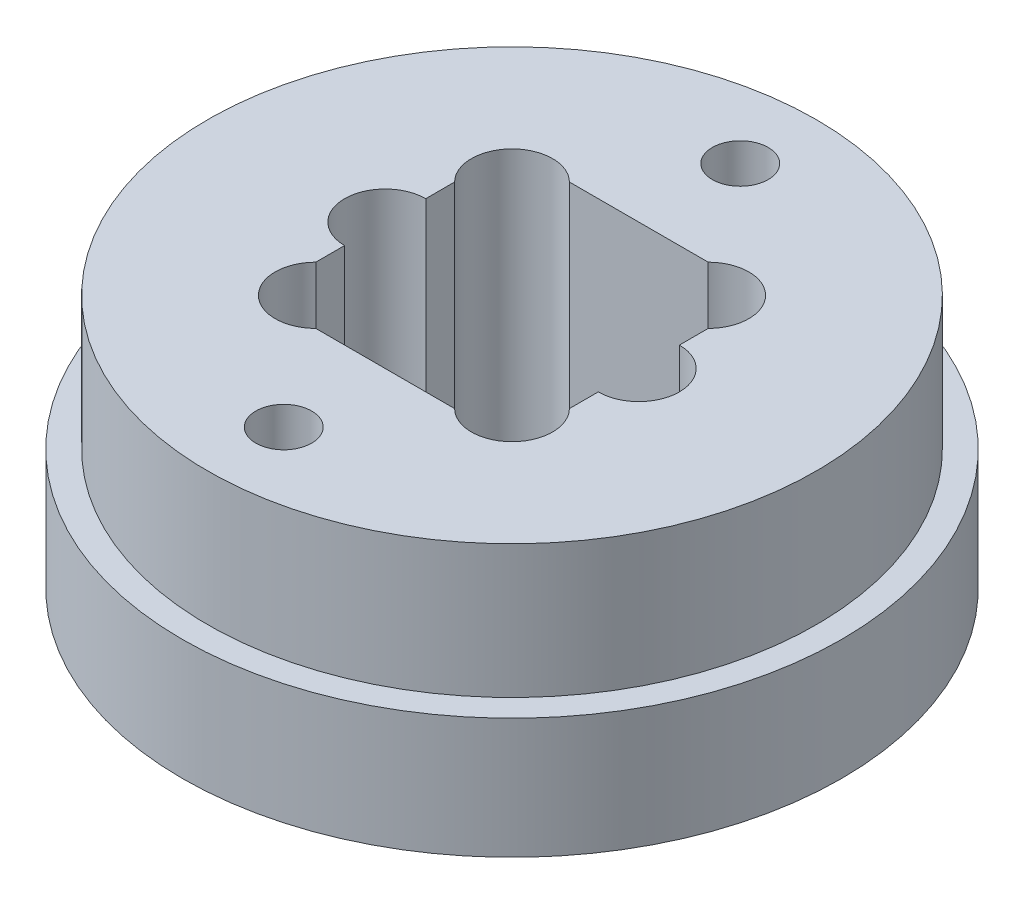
ISO-10303-21;
HEADER;
FILE_DESCRIPTION(('STEP AP214'),'2;1');
FILE_NAME('part.step','',(''),(''),'','','');
FILE_SCHEMA(('AUTOMOTIVE_DESIGN { 1 0 10303 214 1 1 1 1 }'));
ENDSEC;
DATA;
#1=APPLICATION_CONTEXT('core data for automotive mechanical design processes');
#2=APPLICATION_PROTOCOL_DEFINITION('international standard','automotive_design',2000,#1);
#3=PRODUCT_CONTEXT('',#1,'mechanical');
#4=PRODUCT('Part','Part','',(#3));
#5=PRODUCT_RELATED_PRODUCT_CATEGORY('part','',(#4));
#6=PRODUCT_DEFINITION_FORMATION('','',#4);
#7=PRODUCT_DEFINITION_CONTEXT('part definition',#1,'design');
#8=PRODUCT_DEFINITION('design','',#6,#7);
#9=PRODUCT_DEFINITION_SHAPE('','',#8);
#10=(LENGTH_UNIT() NAMED_UNIT(*) SI_UNIT(.MILLI.,.METRE.));
#11=(NAMED_UNIT(*) PLANE_ANGLE_UNIT() SI_UNIT($,.RADIAN.));
#12=(NAMED_UNIT(*) SI_UNIT($,.STERADIAN.) SOLID_ANGLE_UNIT());
#13=UNCERTAINTY_MEASURE_WITH_UNIT(LENGTH_MEASURE(1.E-05),#10,'distance_accuracy_value','');
#14=(GEOMETRIC_REPRESENTATION_CONTEXT(3) GLOBAL_UNCERTAINTY_ASSIGNED_CONTEXT((#13)) GLOBAL_UNIT_ASSIGNED_CONTEXT((#10,
#11,#12)) REPRESENTATION_CONTEXT('',''));
#15=CARTESIAN_POINT('',(0.,0.,0.));
#16=DIRECTION('',(0.,0.,1.));
#17=DIRECTION('',(1.,0.,0.));
#18=AXIS2_PLACEMENT_3D('',#15,#16,#17);
#19=CARTESIAN_POINT('',(5.,0.,-2.73725830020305));
#20=DIRECTION('',(1.,0.,0.));
#21=DIRECTION('',(0.,0.,-1.));
#22=AXIS2_PLACEMENT_3D('',#19,#20,#21);
#23=PLANE('',#22);
#24=DIRECTION('',(0.,0.,-1.));
#25=VECTOR('',#24,1.);
#26=CARTESIAN_POINT('',(5.,10.,-2.73725830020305));
#27=LINE('',#26,#25);
#28=CARTESIAN_POINT('',(4.99999999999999,10.,2.73725830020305));
#29=VERTEX_POINT('',#28);
#30=CARTESIAN_POINT('',(4.99999999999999,10.,1.6));
#31=VERTEX_POINT('',#30);
#32=EDGE_CURVE('E131',#29,#31,#27,.T.);
#33=ORIENTED_EDGE('',*,*,#32,.T.);
#34=DIRECTION('',(0.,-1.,0.));
#35=VECTOR('',#34,1.);
#36=CARTESIAN_POINT('',(4.99999999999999,10.,1.6));
#37=LINE('',#36,#35);
#38=CARTESIAN_POINT('',(4.99999999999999,0.,1.6));
#39=VERTEX_POINT('',#38);
#40=EDGE_CURVE('E11',#31,#39,#37,.T.);
#41=ORIENTED_EDGE('',*,*,#40,.T.);
#42=DIRECTION('',(0.,0.,-1.));
#43=VECTOR('',#42,1.);
#44=CARTESIAN_POINT('',(5.,0.,-2.73725830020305));
#45=LINE('',#44,#43);
#46=CARTESIAN_POINT('',(4.99999999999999,0.,2.73725830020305));
#47=VERTEX_POINT('',#46);
#48=EDGE_CURVE('E128',#47,#39,#45,.T.);
#49=ORIENTED_EDGE('',*,*,#48,.F.);
#50=DIRECTION('',(0.,1.,0.));
#51=VECTOR('',#50,1.);
#52=CARTESIAN_POINT('',(4.99999999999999,0.,2.73725830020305));
#53=LINE('',#52,#51);
#54=EDGE_CURVE('E182',#47,#29,#53,.T.);
#55=ORIENTED_EDGE('',*,*,#54,.T.);
#56=EDGE_LOOP('',(#33,#41,#49,#55));
#57=FACE_BOUND('',#56,.T.);
#58=ADVANCED_FACE('F32',(#57),#23,.F.);
#59=CARTESIAN_POINT('',(-5.,0.,-2.73725830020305));
#60=DIRECTION('',(-1.,0.,0.));
#61=DIRECTION('',(0.,0.,1.));
#62=AXIS2_PLACEMENT_3D('',#59,#60,#61);
#63=PLANE('',#62);
#64=DIRECTION('',(0.,0.,1.));
#65=VECTOR('',#64,1.);
#66=CARTESIAN_POINT('',(-5.,10.,-2.73725830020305));
#67=LINE('',#66,#65);
#68=CARTESIAN_POINT('',(-5.,10.,-2.73725830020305));
#69=VERTEX_POINT('',#68);
#70=CARTESIAN_POINT('',(-5.,10.,-1.6));
#71=VERTEX_POINT('',#70);
#72=EDGE_CURVE('E153',#69,#71,#67,.T.);
#73=ORIENTED_EDGE('',*,*,#72,.T.);
#74=DIRECTION('',(0.,-1.,0.));
#75=VECTOR('',#74,1.);
#76=CARTESIAN_POINT('',(-5.,10.,-1.6));
#77=LINE('',#76,#75);
#78=CARTESIAN_POINT('',(-5.,0.,-1.6));
#79=VERTEX_POINT('',#78);
#80=EDGE_CURVE('E206',#71,#79,#77,.T.);
#81=ORIENTED_EDGE('',*,*,#80,.T.);
#82=DIRECTION('',(0.,0.,1.));
#83=VECTOR('',#82,1.);
#84=CARTESIAN_POINT('',(-5.,0.,-2.73725830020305));
#85=LINE('',#84,#83);
#86=CARTESIAN_POINT('',(-5.,0.,-2.73725830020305));
#87=VERTEX_POINT('',#86);
#88=EDGE_CURVE('E232',#87,#79,#85,.T.);
#89=ORIENTED_EDGE('',*,*,#88,.F.);
#90=DIRECTION('',(0.,1.,0.));
#91=VECTOR('',#90,1.);
#92=CARTESIAN_POINT('',(-5.,0.,-2.73725830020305));
#93=LINE('',#92,#91);
#94=EDGE_CURVE('E148',#87,#69,#93,.T.);
#95=ORIENTED_EDGE('',*,*,#94,.T.);
#96=EDGE_LOOP('',(#73,#81,#89,#95));
#97=FACE_BOUND('',#96,.T.);
#98=ADVANCED_FACE('F290',(#97),#63,.F.);
#99=CARTESIAN_POINT('',(0.,4.75,0.));
#100=DIRECTION('',(0.,1.,0.));
#101=DIRECTION('',(0.,0.,1.));
#102=AXIS2_PLACEMENT_3D('',#99,#100,#101);
#103=PLANE('',#102);
#104=CARTESIAN_POINT('',(0.,4.75,0.));
#105=DIRECTION('',(0.,1.,0.));
#106=DIRECTION('',(0.,0.,1.));
#107=AXIS2_PLACEMENT_3D('',#104,#105,#106);
#108=CIRCLE('',#107,13.);
#109=CARTESIAN_POINT('',(0.,4.75,13.));
#110=VERTEX_POINT('',#109);
#111=EDGE_CURVE('E199',#110,#110,#108,.T.);
#112=ORIENTED_EDGE('',*,*,#111,.T.);
#113=EDGE_LOOP('',(#112));
#114=FACE_BOUND('',#113,.T.);
#115=CARTESIAN_POINT('',(0.,4.75,0.));
#116=DIRECTION('',(0.,1.,0.));
#117=DIRECTION('',(0.,0.,1.));
#118=AXIS2_PLACEMENT_3D('',#115,#116,#117);
#119=CIRCLE('',#118,12.);
#120=CARTESIAN_POINT('',(0.,4.75,-12.));
#121=VERTEX_POINT('',#120);
#122=EDGE_CURVE('E176',#121,#121,#119,.T.);
#123=ORIENTED_EDGE('',*,*,#122,.F.);
#124=EDGE_LOOP('',(#123));
#125=FACE_BOUND('',#124,.T.);
#126=ADVANCED_FACE('F288',(#114,#125),#103,.T.);
#127=CARTESIAN_POINT('',(0.,4.75,0.));
#128=DIRECTION('',(0.,-1.,0.));
#129=DIRECTION('',(0.,0.,-1.));
#130=AXIS2_PLACEMENT_3D('',#127,#128,#129);
#131=CYLINDRICAL_SURFACE('',#130,13.);
#132=ORIENTED_EDGE('',*,*,#111,.F.);
#133=EDGE_LOOP('',(#132));
#134=FACE_BOUND('',#133,.T.);
#135=CARTESIAN_POINT('',(0.,0.,0.));
#136=DIRECTION('',(0.,1.,0.));
#137=DIRECTION('',(0.,0.,1.));
#138=AXIS2_PLACEMENT_3D('',#135,#136,#137);
#139=CIRCLE('',#138,13.);
#140=CARTESIAN_POINT('',(0.,0.,13.));
#141=VERTEX_POINT('',#140);
#142=EDGE_CURVE('E196',#141,#141,#139,.T.);
#143=ORIENTED_EDGE('',*,*,#142,.T.);
#144=EDGE_LOOP('',(#143));
#145=FACE_BOUND('',#144,.T.);
#146=ADVANCED_FACE('F34',(#134,#145),#131,.T.);
#147=CARTESIAN_POINT('',(0.,0.,0.));
#148=DIRECTION('',(0.,1.,0.));
#149=DIRECTION('',(0.,0.,1.));
#150=AXIS2_PLACEMENT_3D('',#147,#148,#149);
#151=PLANE('',#150);
#152=CARTESIAN_POINT('',(0.,0.,-9.));
#153=DIRECTION('',(0.,1.,0.));
#154=DIRECTION('',(0.,0.,-1.));
#155=AXIS2_PLACEMENT_3D('',#152,#153,#154);
#156=CIRCLE('',#155,1.1);
#157=CARTESIAN_POINT('',(0.,0.,-10.1));
#158=VERTEX_POINT('',#157);
#159=EDGE_CURVE('E265',#158,#158,#156,.T.);
#160=ORIENTED_EDGE('',*,*,#159,.T.);
#161=EDGE_LOOP('',(#160));
#162=FACE_BOUND('',#161,.T.);
#163=CARTESIAN_POINT('',(0.,0.,9.));
#164=DIRECTION('',(0.,1.,0.));
#165=DIRECTION('',(0.,0.,1.));
#166=AXIS2_PLACEMENT_3D('',#163,#164,#165);
#167=CIRCLE('',#166,1.1);
#168=CARTESIAN_POINT('',(0.,0.,10.1));
#169=VERTEX_POINT('',#168);
#170=EDGE_CURVE('E152',#169,#169,#167,.T.);
#171=ORIENTED_EDGE('',*,*,#170,.T.);
#172=EDGE_LOOP('',(#171));
#173=FACE_BOUND('',#172,.T.);
#174=ORIENTED_EDGE('',*,*,#48,.T.);
#175=CARTESIAN_POINT('',(5.,0.,0.));
#176=DIRECTION('',(0.,-1.,0.));
#177=DIRECTION('',(0.,0.,1.));
#178=AXIS2_PLACEMENT_3D('',#175,#176,#177);
#179=CIRCLE('',#178,1.6);
#180=CARTESIAN_POINT('',(5.,0.,-1.6));
#181=VERTEX_POINT('',#180);
#182=EDGE_CURVE('E119',#181,#39,#179,.T.);
#183=ORIENTED_EDGE('',*,*,#182,.F.);
#184=CARTESIAN_POINT('',(5.,0.,-2.73725830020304));
#185=VERTEX_POINT('',#184);
#186=EDGE_CURVE('E138',#181,#185,#45,.T.);
#187=ORIENTED_EDGE('',*,*,#186,.T.);
#188=CARTESIAN_POINT('',(3.86862915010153,0.,-3.86862915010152));
#189=DIRECTION('',(0.,1.,0.));
#190=DIRECTION('',(0.,0.,-1.));
#191=AXIS2_PLACEMENT_3D('',#188,#189,#190);
#192=CIRCLE('',#191,1.6);
#193=CARTESIAN_POINT('',(2.73725830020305,0.,-5.));
#194=VERTEX_POINT('',#193);
#195=EDGE_CURVE('E137',#185,#194,#192,.T.);
#196=ORIENTED_EDGE('',*,*,#195,.T.);
#197=DIRECTION('',(-1.,0.,0.));
#198=VECTOR('',#197,1.);
#199=CARTESIAN_POINT('',(-2.73725830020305,0.,-5.));
#200=LINE('',#199,#198);
#201=CARTESIAN_POINT('',(-2.73725830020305,0.,-5.));
#202=VERTEX_POINT('',#201);
#203=EDGE_CURVE('E141',#194,#202,#200,.T.);
#204=ORIENTED_EDGE('',*,*,#203,.T.);
#205=CARTESIAN_POINT('',(-3.86862915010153,0.,-3.86862915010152));
#206=DIRECTION('',(0.,1.,0.));
#207=DIRECTION('',(0.,0.,1.));
#208=AXIS2_PLACEMENT_3D('',#205,#206,#207);
#209=CIRCLE('',#208,1.6);
#210=EDGE_CURVE('E173',#202,#87,#209,.T.);
#211=ORIENTED_EDGE('',*,*,#210,.T.);
#212=ORIENTED_EDGE('',*,*,#88,.T.);
#213=CARTESIAN_POINT('',(-5.,0.,0.));
#214=DIRECTION('',(0.,-1.,0.));
#215=DIRECTION('',(0.,0.,-1.));
#216=AXIS2_PLACEMENT_3D('',#213,#214,#215);
#217=CIRCLE('',#216,1.6);
#218=CARTESIAN_POINT('',(-5.,0.,1.6));
#219=VERTEX_POINT('',#218);
#220=EDGE_CURVE('E259',#219,#79,#217,.T.);
#221=ORIENTED_EDGE('',*,*,#220,.F.);
#222=CARTESIAN_POINT('',(-5.,0.,2.73725830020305));
#223=VERTEX_POINT('',#222);
#224=EDGE_CURVE('E230',#219,#223,#85,.T.);
#225=ORIENTED_EDGE('',*,*,#224,.T.);
#226=CARTESIAN_POINT('',(-3.86862915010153,0.,3.86862915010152));
#227=DIRECTION('',(0.,1.,0.));
#228=DIRECTION('',(0.,0.,-1.));
#229=AXIS2_PLACEMENT_3D('',#226,#227,#228);
#230=CIRCLE('',#229,1.6);
#231=CARTESIAN_POINT('',(-2.73725830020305,0.,5.));
#232=VERTEX_POINT('',#231);
#233=EDGE_CURVE('E238',#223,#232,#230,.T.);
#234=ORIENTED_EDGE('',*,*,#233,.T.);
#235=DIRECTION('',(1.,0.,0.));
#236=VECTOR('',#235,1.);
#237=CARTESIAN_POINT('',(-2.73725830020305,0.,5.));
#238=LINE('',#237,#236);
#239=CARTESIAN_POINT('',(2.73725830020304,0.,5.));
#240=VERTEX_POINT('',#239);
#241=EDGE_CURVE('E240',#232,#240,#238,.T.);
#242=ORIENTED_EDGE('',*,*,#241,.T.);
#243=CARTESIAN_POINT('',(3.86862915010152,0.,3.86862915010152));
#244=DIRECTION('',(0.,1.,0.));
#245=DIRECTION('',(0.,0.,1.));
#246=AXIS2_PLACEMENT_3D('',#243,#244,#245);
#247=CIRCLE('',#246,1.6);
#248=EDGE_CURVE('E136',#240,#47,#247,.T.);
#249=ORIENTED_EDGE('',*,*,#248,.T.);
#250=EDGE_LOOP('',(#174,#183,#187,#196,#204,#211,#212,#221,#225,#234,#242,#249));
#251=FACE_BOUND('',#250,.T.);
#252=ORIENTED_EDGE('',*,*,#142,.F.);
#253=EDGE_LOOP('',(#252));
#254=FACE_BOUND('',#253,.T.);
#255=ADVANCED_FACE('F132',(#162,#173,#251,#254),#151,.F.);
#256=CARTESIAN_POINT('',(0.,10.,0.));
#257=DIRECTION('',(0.,-1.,0.));
#258=DIRECTION('',(0.,0.,-1.));
#259=AXIS2_PLACEMENT_3D('',#256,#257,#258);
#260=CYLINDRICAL_SURFACE('',#259,12.);
#261=CARTESIAN_POINT('',(0.,10.,0.));
#262=DIRECTION('',(0.,1.,0.));
#263=DIRECTION('',(0.,0.,1.));
#264=AXIS2_PLACEMENT_3D('',#261,#262,#263);
#265=CIRCLE('',#264,12.);
#266=CARTESIAN_POINT('',(0.,10.,-12.));
#267=VERTEX_POINT('',#266);
#268=EDGE_CURVE('E193',#267,#267,#265,.T.);
#269=CARTESIAN_POINT('',(0.,10.,-12.));
#270=CARTESIAN_POINT('',(0.,9.9453125,-12.));
#271=CARTESIAN_POINT('',(0.,9.890625,-12.));
#272=CARTESIAN_POINT('',(0.,9.78125,-12.));
#273=CARTESIAN_POINT('',(0.,9.7265625,-12.));
#274=CARTESIAN_POINT('',(0.,9.6171875,-12.));
#275=CARTESIAN_POINT('',(0.,9.5625,-12.));
#276=CARTESIAN_POINT('',(0.,9.453125,-12.));
#277=CARTESIAN_POINT('',(0.,9.3984375,-12.));
#278=CARTESIAN_POINT('',(0.,9.2890625,-12.));
#279=CARTESIAN_POINT('',(0.,9.234375,-12.));
#280=CARTESIAN_POINT('',(0.,9.125,-12.));
#281=CARTESIAN_POINT('',(0.,9.0703125,-12.));
#282=CARTESIAN_POINT('',(0.,8.9609375,-12.));
#283=CARTESIAN_POINT('',(0.,8.90625,-12.));
#284=CARTESIAN_POINT('',(0.,8.796875,-12.));
#285=CARTESIAN_POINT('',(0.,8.7421875,-12.));
#286=CARTESIAN_POINT('',(0.,8.6328125,-12.));
#287=CARTESIAN_POINT('',(0.,8.578125,-12.));
#288=CARTESIAN_POINT('',(0.,8.46875,-12.));
#289=CARTESIAN_POINT('',(0.,8.4140625,-12.));
#290=CARTESIAN_POINT('',(0.,8.3046875,-12.));
#291=CARTESIAN_POINT('',(0.,8.25,-12.));
#292=CARTESIAN_POINT('',(0.,8.140625,-12.));
#293=CARTESIAN_POINT('',(0.,8.0859375,-12.));
#294=CARTESIAN_POINT('',(0.,7.9765625,-12.));
#295=CARTESIAN_POINT('',(0.,7.921875,-12.));
#296=CARTESIAN_POINT('',(0.,7.8125,-12.));
#297=CARTESIAN_POINT('',(0.,7.7578125,-12.));
#298=CARTESIAN_POINT('',(0.,7.6484375,-12.));
#299=CARTESIAN_POINT('',(0.,7.59375,-12.));
#300=CARTESIAN_POINT('',(0.,7.484375,-12.));
#301=CARTESIAN_POINT('',(0.,7.4296875,-12.));
#302=CARTESIAN_POINT('',(0.,7.3203125,-12.));
#303=CARTESIAN_POINT('',(0.,7.265625,-12.));
#304=CARTESIAN_POINT('',(0.,7.15625,-12.));
#305=CARTESIAN_POINT('',(0.,7.1015625,-12.));
#306=CARTESIAN_POINT('',(0.,6.9921875,-12.));
#307=CARTESIAN_POINT('',(0.,6.9375,-12.));
#308=CARTESIAN_POINT('',(0.,6.828125,-12.));
#309=CARTESIAN_POINT('',(0.,6.7734375,-12.));
#310=CARTESIAN_POINT('',(0.,6.6640625,-12.));
#311=CARTESIAN_POINT('',(0.,6.609375,-12.));
#312=CARTESIAN_POINT('',(0.,6.5,-12.));
#313=CARTESIAN_POINT('',(0.,6.4453125,-12.));
#314=CARTESIAN_POINT('',(0.,6.3359375,-12.));
#315=CARTESIAN_POINT('',(0.,6.28125,-12.));
#316=CARTESIAN_POINT('',(0.,6.171875,-12.));
#317=CARTESIAN_POINT('',(0.,6.1171875,-12.));
#318=CARTESIAN_POINT('',(0.,6.0078125,-12.));
#319=CARTESIAN_POINT('',(0.,5.953125,-12.));
#320=CARTESIAN_POINT('',(0.,5.84375,-12.));
#321=CARTESIAN_POINT('',(0.,5.7890625,-12.));
#322=CARTESIAN_POINT('',(0.,5.6796875,-12.));
#323=CARTESIAN_POINT('',(0.,5.625,-12.));
#324=CARTESIAN_POINT('',(0.,5.515625,-12.));
#325=CARTESIAN_POINT('',(0.,5.4609375,-12.));
#326=CARTESIAN_POINT('',(0.,5.3515625,-12.));
#327=CARTESIAN_POINT('',(0.,5.296875,-12.));
#328=CARTESIAN_POINT('',(0.,5.1875,-12.));
#329=CARTESIAN_POINT('',(0.,5.1328125,-12.));
#330=CARTESIAN_POINT('',(0.,5.0234375,-12.));
#331=CARTESIAN_POINT('',(0.,4.96875,-12.));
#332=CARTESIAN_POINT('',(0.,4.859375,-12.));
#333=CARTESIAN_POINT('',(0.,4.8046875,-12.));
#334=CARTESIAN_POINT('',(0.,4.75,-12.));
#335=B_SPLINE_CURVE_WITH_KNOTS('',3,(#269,#270,#271,#272,#273,#274,#275,#276,#277,#278,#279,
#280,#281,#282,#283,#284,#285,#286,#287,#288,#289,#290,#291,#292,#293,#294,#295,#296,#297,#298,
#299,#300,#301,#302,#303,#304,#305,#306,#307,#308,#309,#310,#311,#312,#313,#314,#315,#316,#317,
#318,#319,#320,#321,#322,#323,#324,#325,#326,#327,#328,#329,#330,#331,#332,#333,#334),
.UNSPECIFIED.,.F.,.F.,(4,2,2,2,2,2,2,2,2,2,2,2,2,2,2,2,2,2,2,2,2,2,2,2,2,2,2,2,2,2,2,2,4),(0.,
0.164062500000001,0.328125,0.492187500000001,0.656250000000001,0.820312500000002,
0.984375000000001,1.1484375,1.3125,1.4765625,1.640625,1.8046875,1.96875,2.1328125,2.296875,
2.4609375,2.625,2.7890625,2.953125,3.1171875,3.28125,3.4453125,3.609375,3.7734375,3.9375,
4.1015625,4.265625,4.4296875,4.59375,4.7578125,4.921875,5.0859375,5.25),.UNSPECIFIED.);
#336=EDGE_CURVE('BSEAM279',#267,#121,#335,.T.);
#337=ORIENTED_EDGE('',*,*,#268,.F.);
#338=ORIENTED_EDGE('',*,*,#122,.T.);
#339=ORIENTED_EDGE('',*,*,#336,.T.);
#340=ORIENTED_EDGE('',*,*,#336,.F.);
#341=EDGE_LOOP('',(#337,#339,#338,#340));
#342=FACE_BOUND('',#341,.T.);
#343=ADVANCED_FACE('F279',(#342),#260,.T.);
#344=CARTESIAN_POINT('',(0.,10.,0.));
#345=DIRECTION('',(0.,1.,0.));
#346=DIRECTION('',(0.,0.,1.));
#347=AXIS2_PLACEMENT_3D('',#344,#345,#346);
#348=PLANE('',#347);
#349=CARTESIAN_POINT('',(5.,10.,0.));
#350=DIRECTION('',(0.,-1.,0.));
#351=DIRECTION('',(0.,0.,1.));
#352=AXIS2_PLACEMENT_3D('',#349,#350,#351);
#353=CIRCLE('',#352,1.6);
#354=CARTESIAN_POINT('',(5.,10.,-1.6));
#355=VERTEX_POINT('',#354);
#356=EDGE_CURVE('E47',#355,#31,#353,.T.);
#357=ORIENTED_EDGE('',*,*,#356,.T.);
#358=ORIENTED_EDGE('',*,*,#32,.F.);
#359=CARTESIAN_POINT('',(3.86862915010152,10.,3.86862915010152));
#360=DIRECTION('',(0.,1.,0.));
#361=DIRECTION('',(0.,0.,1.));
#362=AXIS2_PLACEMENT_3D('',#359,#360,#361);
#363=CIRCLE('',#362,1.6);
#364=CARTESIAN_POINT('',(2.73725830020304,10.,5.));
#365=VERTEX_POINT('',#364);
#366=EDGE_CURVE('E162',#365,#29,#363,.T.);
#367=ORIENTED_EDGE('',*,*,#366,.F.);
#368=DIRECTION('',(1.,0.,0.));
#369=VECTOR('',#368,1.);
#370=CARTESIAN_POINT('',(-2.73725830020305,10.,5.));
#371=LINE('',#370,#369);
#372=CARTESIAN_POINT('',(-2.73725830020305,10.,5.));
#373=VERTEX_POINT('',#372);
#374=EDGE_CURVE('E159',#373,#365,#371,.T.);
#375=ORIENTED_EDGE('',*,*,#374,.F.);
#376=CARTESIAN_POINT('',(-3.86862915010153,10.,3.86862915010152));
#377=DIRECTION('',(0.,1.,0.));
#378=DIRECTION('',(0.,0.,-1.));
#379=AXIS2_PLACEMENT_3D('',#376,#377,#378);
#380=CIRCLE('',#379,1.6);
#381=CARTESIAN_POINT('',(-5.,10.,2.73725830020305));
#382=VERTEX_POINT('',#381);
#383=EDGE_CURVE('E156',#382,#373,#380,.T.);
#384=ORIENTED_EDGE('',*,*,#383,.F.);
#385=CARTESIAN_POINT('',(-5.,10.,1.6));
#386=VERTEX_POINT('',#385);
#387=EDGE_CURVE('E151',#386,#382,#67,.T.);
#388=ORIENTED_EDGE('',*,*,#387,.F.);
#389=CARTESIAN_POINT('',(-5.,10.,0.));
#390=DIRECTION('',(0.,-1.,0.));
#391=DIRECTION('',(0.,0.,-1.));
#392=AXIS2_PLACEMENT_3D('',#389,#390,#391);
#393=CIRCLE('',#392,1.6);
#394=EDGE_CURVE('E55',#386,#71,#393,.T.);
#395=ORIENTED_EDGE('',*,*,#394,.T.);
#396=ORIENTED_EDGE('',*,*,#72,.F.);
#397=CARTESIAN_POINT('',(-3.86862915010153,10.,-3.86862915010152));
#398=DIRECTION('',(0.,1.,0.));
#399=DIRECTION('',(0.,0.,1.));
#400=AXIS2_PLACEMENT_3D('',#397,#398,#399);
#401=CIRCLE('',#400,1.6);
#402=CARTESIAN_POINT('',(-2.73725830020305,10.,-5.));
#403=VERTEX_POINT('',#402);
#404=EDGE_CURVE('E149',#403,#69,#401,.T.);
#405=ORIENTED_EDGE('',*,*,#404,.F.);
#406=DIRECTION('',(-1.,0.,0.));
#407=VECTOR('',#406,1.);
#408=CARTESIAN_POINT('',(-2.73725830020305,10.,-5.));
#409=LINE('',#408,#407);
#410=CARTESIAN_POINT('',(2.73725830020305,10.,-5.));
#411=VERTEX_POINT('',#410);
#412=EDGE_CURVE('E170',#411,#403,#409,.T.);
#413=ORIENTED_EDGE('',*,*,#412,.F.);
#414=CARTESIAN_POINT('',(3.86862915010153,10.,-3.86862915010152));
#415=DIRECTION('',(0.,1.,0.));
#416=DIRECTION('',(0.,0.,-1.));
#417=AXIS2_PLACEMENT_3D('',#414,#415,#416);
#418=CIRCLE('',#417,1.6);
#419=CARTESIAN_POINT('',(5.,10.,-2.73725830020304));
#420=VERTEX_POINT('',#419);
#421=EDGE_CURVE('E167',#420,#411,#418,.T.);
#422=ORIENTED_EDGE('',*,*,#421,.F.);
#423=EDGE_CURVE('E165',#355,#420,#27,.T.);
#424=ORIENTED_EDGE('',*,*,#423,.F.);
#425=EDGE_LOOP('',(#357,#358,#367,#375,#384,#388,#395,#396,#405,#413,#422,#424));
#426=FACE_BOUND('',#425,.T.);
#427=CARTESIAN_POINT('',(0.,10.,-9.));
#428=DIRECTION('',(0.,1.,0.));
#429=DIRECTION('',(0.,0.,-1.));
#430=AXIS2_PLACEMENT_3D('',#427,#428,#429);
#431=CIRCLE('',#430,1.1);
#432=CARTESIAN_POINT('',(0.,10.,-10.1));
#433=VERTEX_POINT('',#432);
#434=EDGE_CURVE('E261',#433,#433,#431,.T.);
#435=ORIENTED_EDGE('',*,*,#434,.F.);
#436=EDGE_LOOP('',(#435));
#437=FACE_BOUND('',#436,.T.);
#438=CARTESIAN_POINT('',(0.,10.,9.));
#439=DIRECTION('',(0.,1.,0.));
#440=DIRECTION('',(0.,0.,1.));
#441=AXIS2_PLACEMENT_3D('',#438,#439,#440);
#442=CIRCLE('',#441,1.1);
#443=CARTESIAN_POINT('',(0.,10.,10.1));
#444=VERTEX_POINT('',#443);
#445=EDGE_CURVE('E235',#444,#444,#442,.T.);
#446=ORIENTED_EDGE('',*,*,#445,.F.);
#447=EDGE_LOOP('',(#446));
#448=FACE_BOUND('',#447,.T.);
#449=ORIENTED_EDGE('',*,*,#268,.T.);
#450=EDGE_LOOP('',(#449));
#451=FACE_BOUND('',#450,.T.);
#452=ADVANCED_FACE('F214',(#426,#437,#448,#451),#348,.T.);
#453=CARTESIAN_POINT('',(-3.86862915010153,0.,-3.86862915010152));
#454=DIRECTION('',(0.,1.,0.));
#455=DIRECTION('',(0.,0.,1.));
#456=AXIS2_PLACEMENT_3D('',#453,#454,#455);
#457=CYLINDRICAL_SURFACE('',#456,1.6);
#458=ORIENTED_EDGE('',*,*,#404,.T.);
#459=ORIENTED_EDGE('',*,*,#94,.F.);
#460=ORIENTED_EDGE('',*,*,#210,.F.);
#461=DIRECTION('',(0.,1.,0.));
#462=VECTOR('',#461,1.);
#463=CARTESIAN_POINT('',(-2.73725830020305,0.,-5.));
#464=LINE('',#463,#462);
#465=EDGE_CURVE('E174',#202,#403,#464,.T.);
#466=ORIENTED_EDGE('',*,*,#465,.T.);
#467=EDGE_LOOP('',(#458,#459,#460,#466));
#468=FACE_BOUND('',#467,.T.);
#469=ADVANCED_FACE('F228',(#468),#457,.F.);
#470=CARTESIAN_POINT('',(-2.73725830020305,0.,-5.));
#471=DIRECTION('',(0.,0.,-1.));
#472=DIRECTION('',(-1.,0.,0.));
#473=AXIS2_PLACEMENT_3D('',#470,#471,#472);
#474=PLANE('',#473);
#475=ORIENTED_EDGE('',*,*,#412,.T.);
#476=ORIENTED_EDGE('',*,*,#465,.F.);
#477=ORIENTED_EDGE('',*,*,#203,.F.);
#478=DIRECTION('',(0.,1.,0.));
#479=VECTOR('',#478,1.);
#480=CARTESIAN_POINT('',(2.73725830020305,0.,-5.));
#481=LINE('',#480,#479);
#482=EDGE_CURVE('E177',#194,#411,#481,.T.);
#483=ORIENTED_EDGE('',*,*,#482,.T.);
#484=EDGE_LOOP('',(#475,#476,#477,#483));
#485=FACE_BOUND('',#484,.T.);
#486=ADVANCED_FACE('F226',(#485),#474,.F.);
#487=CARTESIAN_POINT('',(3.86862915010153,0.,-3.86862915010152));
#488=DIRECTION('',(0.,1.,0.));
#489=DIRECTION('',(0.,0.,1.));
#490=AXIS2_PLACEMENT_3D('',#487,#488,#489);
#491=CYLINDRICAL_SURFACE('',#490,1.6);
#492=ORIENTED_EDGE('',*,*,#421,.T.);
#493=ORIENTED_EDGE('',*,*,#482,.F.);
#494=ORIENTED_EDGE('',*,*,#195,.F.);
#495=DIRECTION('',(0.,1.,0.));
#496=VECTOR('',#495,1.);
#497=CARTESIAN_POINT('',(5.,0.,-2.73725830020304));
#498=LINE('',#497,#496);
#499=EDGE_CURVE('E179',#185,#420,#498,.T.);
#500=ORIENTED_EDGE('',*,*,#499,.T.);
#501=EDGE_LOOP('',(#492,#493,#494,#500));
#502=FACE_BOUND('',#501,.T.);
#503=ADVANCED_FACE('F219',(#502),#491,.F.);
#504=ORIENTED_EDGE('',*,*,#186,.F.);
#505=DIRECTION('',(0.,-1.,0.));
#506=VECTOR('',#505,1.);
#507=CARTESIAN_POINT('',(5.,10.,-1.6));
#508=LINE('',#507,#506);
#509=EDGE_CURVE('E40',#181,#355,#508,.F.);
#510=ORIENTED_EDGE('',*,*,#509,.T.);
#511=ORIENTED_EDGE('',*,*,#423,.T.);
#512=ORIENTED_EDGE('',*,*,#499,.F.);
#513=EDGE_LOOP('',(#504,#510,#511,#512));
#514=FACE_BOUND('',#513,.T.);
#515=ADVANCED_FACE('F210',(#514),#23,.F.);
#516=CARTESIAN_POINT('',(3.86862915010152,0.,3.86862915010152));
#517=DIRECTION('',(0.,1.,0.));
#518=DIRECTION('',(0.,0.,1.));
#519=AXIS2_PLACEMENT_3D('',#516,#517,#518);
#520=CYLINDRICAL_SURFACE('',#519,1.6);
#521=ORIENTED_EDGE('',*,*,#366,.T.);
#522=ORIENTED_EDGE('',*,*,#54,.F.);
#523=ORIENTED_EDGE('',*,*,#248,.F.);
#524=DIRECTION('',(0.,1.,0.));
#525=VECTOR('',#524,1.);
#526=CARTESIAN_POINT('',(2.73725830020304,0.,5.));
#527=LINE('',#526,#525);
#528=EDGE_CURVE('E184',#240,#365,#527,.T.);
#529=ORIENTED_EDGE('',*,*,#528,.T.);
#530=EDGE_LOOP('',(#521,#522,#523,#529));
#531=FACE_BOUND('',#530,.T.);
#532=ADVANCED_FACE('F248',(#531),#520,.F.);
#533=CARTESIAN_POINT('',(-2.73725830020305,0.,5.));
#534=DIRECTION('',(0.,0.,1.));
#535=DIRECTION('',(1.,0.,0.));
#536=AXIS2_PLACEMENT_3D('',#533,#534,#535);
#537=PLANE('',#536);
#538=ORIENTED_EDGE('',*,*,#374,.T.);
#539=ORIENTED_EDGE('',*,*,#528,.F.);
#540=ORIENTED_EDGE('',*,*,#241,.F.);
#541=DIRECTION('',(0.,1.,0.));
#542=VECTOR('',#541,1.);
#543=CARTESIAN_POINT('',(-2.73725830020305,0.,5.));
#544=LINE('',#543,#542);
#545=EDGE_CURVE('E186',#232,#373,#544,.T.);
#546=ORIENTED_EDGE('',*,*,#545,.T.);
#547=EDGE_LOOP('',(#538,#539,#540,#546));
#548=FACE_BOUND('',#547,.T.);
#549=ADVANCED_FACE('F244',(#548),#537,.F.);
#550=CARTESIAN_POINT('',(-3.86862915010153,0.,3.86862915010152));
#551=DIRECTION('',(0.,1.,0.));
#552=DIRECTION('',(0.,0.,1.));
#553=AXIS2_PLACEMENT_3D('',#550,#551,#552);
#554=CYLINDRICAL_SURFACE('',#553,1.6);
#555=ORIENTED_EDGE('',*,*,#383,.T.);
#556=ORIENTED_EDGE('',*,*,#545,.F.);
#557=ORIENTED_EDGE('',*,*,#233,.F.);
#558=DIRECTION('',(0.,1.,0.));
#559=VECTOR('',#558,1.);
#560=CARTESIAN_POINT('',(-5.,0.,2.73725830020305));
#561=LINE('',#560,#559);
#562=EDGE_CURVE('E188',#223,#382,#561,.T.);
#563=ORIENTED_EDGE('',*,*,#562,.T.);
#564=EDGE_LOOP('',(#555,#556,#557,#563));
#565=FACE_BOUND('',#564,.T.);
#566=ADVANCED_FACE('F252',(#565),#554,.F.);
#567=ORIENTED_EDGE('',*,*,#224,.F.);
#568=DIRECTION('',(0.,-1.,0.));
#569=VECTOR('',#568,1.);
#570=CARTESIAN_POINT('',(-5.,10.,1.6));
#571=LINE('',#570,#569);
#572=EDGE_CURVE('E202',#219,#386,#571,.F.);
#573=ORIENTED_EDGE('',*,*,#572,.T.);
#574=ORIENTED_EDGE('',*,*,#387,.T.);
#575=ORIENTED_EDGE('',*,*,#562,.F.);
#576=EDGE_LOOP('',(#567,#573,#574,#575));
#577=FACE_BOUND('',#576,.T.);
#578=ADVANCED_FACE('F256',(#577),#63,.F.);
#579=CARTESIAN_POINT('',(0.,0.,9.));
#580=DIRECTION('',(0.,1.,0.));
#581=DIRECTION('',(0.,0.,1.));
#582=AXIS2_PLACEMENT_3D('',#579,#580,#581);
#583=CYLINDRICAL_SURFACE('',#582,1.1);
#584=ORIENTED_EDGE('',*,*,#170,.F.);
#585=EDGE_LOOP('',(#584));
#586=FACE_BOUND('',#585,.T.);
#587=ORIENTED_EDGE('',*,*,#445,.T.);
#588=EDGE_LOOP('',(#587));
#589=FACE_BOUND('',#588,.T.);
#590=ADVANCED_FACE('F275',(#586,#589),#583,.F.);
#591=CARTESIAN_POINT('',(0.,0.,-9.));
#592=DIRECTION('',(0.,1.,0.));
#593=DIRECTION('',(0.,0.,1.));
#594=AXIS2_PLACEMENT_3D('',#591,#592,#593);
#595=CYLINDRICAL_SURFACE('',#594,1.1);
#596=ORIENTED_EDGE('',*,*,#159,.F.);
#597=EDGE_LOOP('',(#596));
#598=FACE_BOUND('',#597,.T.);
#599=ORIENTED_EDGE('',*,*,#434,.T.);
#600=EDGE_LOOP('',(#599));
#601=FACE_BOUND('',#600,.T.);
#602=ADVANCED_FACE('F318',(#598,#601),#595,.F.);
#603=CARTESIAN_POINT('',(-5.,10.,0.));
#604=DIRECTION('',(0.,-1.,0.));
#605=DIRECTION('',(0.,0.,-1.));
#606=AXIS2_PLACEMENT_3D('',#603,#604,#605);
#607=CYLINDRICAL_SURFACE('',#606,1.6);
#608=ORIENTED_EDGE('',*,*,#394,.F.);
#609=ORIENTED_EDGE('',*,*,#572,.F.);
#610=ORIENTED_EDGE('',*,*,#220,.T.);
#611=ORIENTED_EDGE('',*,*,#80,.F.);
#612=EDGE_LOOP('',(#608,#609,#610,#611));
#613=FACE_BOUND('',#612,.T.);
#614=ADVANCED_FACE('F258',(#613),#607,.F.);
#615=CARTESIAN_POINT('',(5.,10.,0.));
#616=DIRECTION('',(0.,-1.,0.));
#617=DIRECTION('',(0.,0.,-1.));
#618=AXIS2_PLACEMENT_3D('',#615,#616,#617);
#619=CYLINDRICAL_SURFACE('',#618,1.6);
#620=ORIENTED_EDGE('',*,*,#356,.F.);
#621=ORIENTED_EDGE('',*,*,#509,.F.);
#622=ORIENTED_EDGE('',*,*,#182,.T.);
#623=ORIENTED_EDGE('',*,*,#40,.F.);
#624=EDGE_LOOP('',(#620,#621,#622,#623));
#625=FACE_BOUND('',#624,.T.);
#626=ADVANCED_FACE('F120',(#625),#619,.F.);
#627=CLOSED_SHELL('',(#58,#98,#126,#146,#255,#343,#452,#469,#486,#503,#515,#532,#549,#566,#578,
#590,#602,#614,#626));
#628=MANIFOLD_SOLID_BREP('B2',#627);
#629=ADVANCED_BREP_SHAPE_REPRESENTATION('',(#18,#628),#14);
#630=SHAPE_DEFINITION_REPRESENTATION(#9,#629);
ENDSEC;
END-ISO-10303-21;
